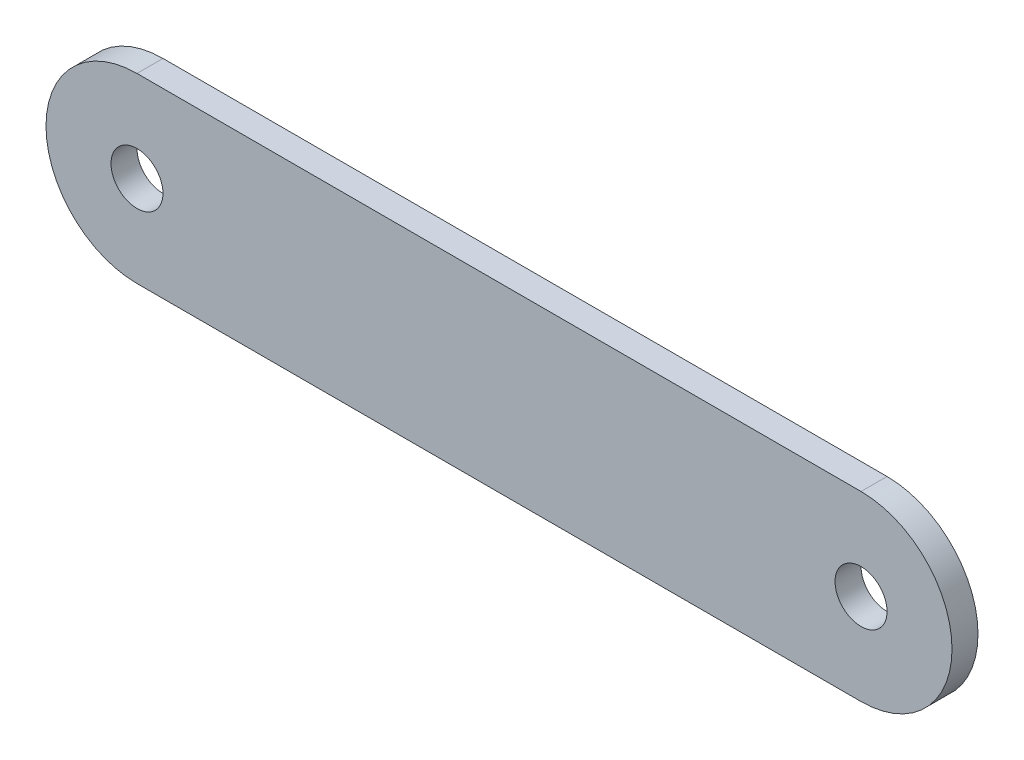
from build123d import *

# Parameters (mm, degrees)
SKETCH1_R           = 50.8
BOSS_EXTRUDE1_DEPTH = 50.8


with BuildPart() as part:
    # Sketch1 → Boss-Extrude1 (new body)
    with BuildSketch(Plane.XY):
        with BuildLine():
            Line((0, 177.8), (1415, 177.8))
            ThreePointArc((1415, 177.8), (1592.8, 0), (1415, -177.8))
            Line((1415, -177.8), (0, -177.8))
            ThreePointArc((0, -177.8), (-177.8, 0), (0, 177.8))
        make_face()
        Circle(SKETCH1_R, mode=Mode.SUBTRACT)
        with Locations((1415, 0)):
            Circle(SKETCH1_R, mode=Mode.SUBTRACT)
    extrude(amount=BOSS_EXTRUDE1_DEPTH)


solid = part.part
